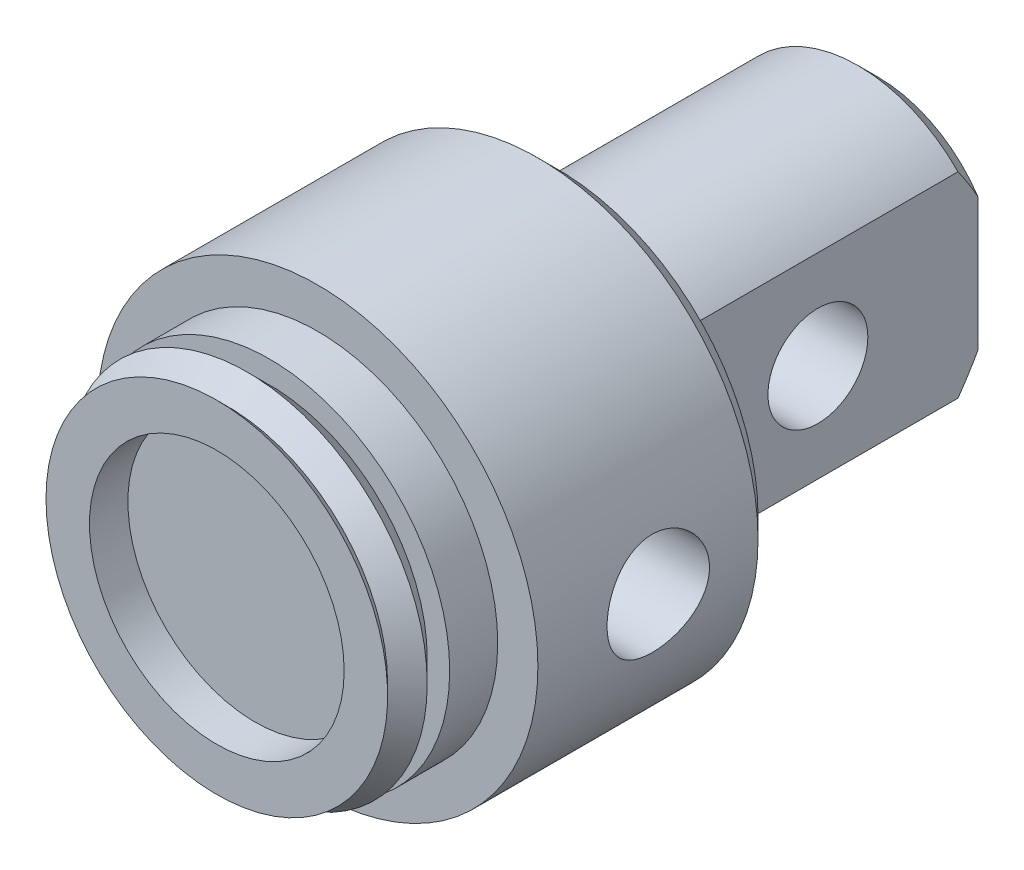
ISO-10303-21;
HEADER;
FILE_DESCRIPTION(('STEP AP214'),'2;1');
FILE_NAME('part.step','',(''),(''),'','','');
FILE_SCHEMA(('AUTOMOTIVE_DESIGN { 1 0 10303 214 1 1 1 1 }'));
ENDSEC;
DATA;
#1=APPLICATION_CONTEXT('core data for automotive mechanical design processes');
#2=APPLICATION_PROTOCOL_DEFINITION('international standard','automotive_design',2000,#1);
#3=PRODUCT_CONTEXT('',#1,'mechanical');
#4=PRODUCT('Part','Part','',(#3));
#5=PRODUCT_RELATED_PRODUCT_CATEGORY('part','',(#4));
#6=PRODUCT_DEFINITION_FORMATION('','',#4);
#7=PRODUCT_DEFINITION_CONTEXT('part definition',#1,'design');
#8=PRODUCT_DEFINITION('design','',#6,#7);
#9=PRODUCT_DEFINITION_SHAPE('','',#8);
#10=(LENGTH_UNIT() NAMED_UNIT(*) SI_UNIT(.MILLI.,.METRE.));
#11=(NAMED_UNIT(*) PLANE_ANGLE_UNIT() SI_UNIT($,.RADIAN.));
#12=(NAMED_UNIT(*) SI_UNIT($,.STERADIAN.) SOLID_ANGLE_UNIT());
#13=UNCERTAINTY_MEASURE_WITH_UNIT(LENGTH_MEASURE(1.E-05),#10,'distance_accuracy_value','');
#14=(GEOMETRIC_REPRESENTATION_CONTEXT(3) GLOBAL_UNCERTAINTY_ASSIGNED_CONTEXT((#13)) GLOBAL_UNIT_ASSIGNED_CONTEXT((#10,
#11,#12)) REPRESENTATION_CONTEXT('',''));
#15=CARTESIAN_POINT('',(0.,0.,0.));
#16=DIRECTION('',(0.,0.,1.));
#17=DIRECTION('',(1.,0.,0.));
#18=AXIS2_PLACEMENT_3D('',#15,#16,#17);
#19=CARTESIAN_POINT('',(0.,0.,-13.523214));
#20=DIRECTION('',(0.,0.,1.));
#21=DIRECTION('',(1.,0.,0.));
#22=AXIS2_PLACEMENT_3D('',#19,#20,#21);
#23=CYLINDRICAL_SURFACE('',#22,8.7376);
#24=CARTESIAN_POINT('',(0.,0.,-12.729464));
#25=DIRECTION('',(0.,0.,-1.));
#26=DIRECTION('',(-1.,0.,0.));
#27=AXIS2_PLACEMENT_3D('',#24,#25,#26);
#28=CIRCLE('',#27,8.7376);
#29=CARTESIAN_POINT('',(8.7376,0.,-12.729464));
#30=VERTEX_POINT('',#29);
#31=EDGE_CURVE('E112',#30,#30,#28,.F.);
#32=ORIENTED_EDGE('',*,*,#31,.T.);
#33=EDGE_LOOP('',(#32));
#34=FACE_BOUND('',#33,.T.);
#35=CARTESIAN_POINT('',(0.,0.,-3.998214));
#36=DIRECTION('',(0.,0.,-1.));
#37=DIRECTION('',(-1.,0.,0.));
#38=AXIS2_PLACEMENT_3D('',#35,#36,#37);
#39=CIRCLE('',#38,8.7376);
#40=CARTESIAN_POINT('',(-8.7376,0.,-3.998214));
#41=VERTEX_POINT('',#40);
#42=EDGE_CURVE('E209',#41,#41,#39,.T.);
#43=ORIENTED_EDGE('',*,*,#42,.T.);
#44=EDGE_LOOP('',(#43));
#45=FACE_BOUND('',#44,.T.);
#46=CARTESIAN_POINT('',(8.7376,0.,-6.741414));
#47=CARTESIAN_POINT('',(8.73759797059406,-0.11251614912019,-6.74141757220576));
#48=CARTESIAN_POINT('',(8.7354047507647,-0.225074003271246,-6.7507908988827));
#49=CARTESIAN_POINT('',(8.72686767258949,-0.446980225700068,-6.78799030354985));
#50=CARTESIAN_POINT('',(8.72052111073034,-0.556326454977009,-6.81582840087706));
#51=CARTESIAN_POINT('',(8.70438234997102,-0.768571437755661,-6.88902854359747));
#52=CARTESIAN_POINT('',(8.6945939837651,-0.871477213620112,-6.9343711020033));
#53=CARTESIAN_POINT('',(8.67262205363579,-1.06821919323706,-7.04122827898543));
#54=CARTESIAN_POINT('',(8.66043848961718,-1.16205539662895,-7.10274289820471));
#55=CARTESIAN_POINT('',(8.63476052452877,-1.33968569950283,-7.2413689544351));
#56=CARTESIAN_POINT('',(8.62124813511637,-1.42329320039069,-7.31871617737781));
#57=CARTESIAN_POINT('',(8.59455904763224,-1.57647313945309,-7.48630623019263));
#58=CARTESIAN_POINT('',(8.58138238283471,-1.64604419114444,-7.57655033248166));
#59=CARTESIAN_POINT('',(8.55667768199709,-1.7700227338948,-7.76878164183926));
#60=CARTESIAN_POINT('',(8.54517260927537,-1.82422727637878,-7.87090295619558));
#61=CARTESIAN_POINT('',(8.52537378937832,-1.91463093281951,-8.0831176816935));
#62=CARTESIAN_POINT('',(8.51707960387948,-1.9508325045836,-8.19321000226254));
#63=CARTESIAN_POINT('',(8.50482562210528,-2.00357737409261,-8.41620527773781));
#64=CARTESIAN_POINT('',(8.50079258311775,-2.02045329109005,-8.5290254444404));
#65=CARTESIAN_POINT('',(8.4972978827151,-2.03510284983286,-8.75596216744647));
#66=CARTESIAN_POINT('',(8.49783558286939,-2.03287915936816,-8.87007854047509));
#67=CARTESIAN_POINT('',(8.50335549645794,-2.00965931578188,-9.09386345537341));
#68=CARTESIAN_POINT('',(8.50824523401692,-1.9890537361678,-9.20357515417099));
#69=CARTESIAN_POINT('',(8.52177157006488,-1.93027563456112,-9.41794037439));
#70=CARTESIAN_POINT('',(8.53040840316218,-1.89210201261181,-9.52259357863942));
#71=CARTESIAN_POINT('',(8.55054421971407,-1.79892392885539,-9.72494736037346));
#72=CARTESIAN_POINT('',(8.56206795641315,-1.7437729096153,-9.82257788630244));
#73=CARTESIAN_POINT('',(8.5866644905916,-1.61830836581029,-10.0073413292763));
#74=CARTESIAN_POINT('',(8.59973752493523,-1.54799252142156,-10.0944726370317));
#75=CARTESIAN_POINT('',(8.62635329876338,-1.39214573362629,-10.2580086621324));
#76=CARTESIAN_POINT('',(8.63989969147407,-1.30628371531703,-10.3340976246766));
#77=CARTESIAN_POINT('',(8.66564488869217,-1.12286054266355,-10.4708516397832));
#78=CARTESIAN_POINT('',(8.67784366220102,-1.02529911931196,-10.5315163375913));
#79=CARTESIAN_POINT('',(8.69956723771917,-0.820833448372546,-10.6357937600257));
#80=CARTESIAN_POINT('',(8.70908487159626,-0.713905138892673,-10.6793608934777));
#81=CARTESIAN_POINT('',(8.72432110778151,-0.493973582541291,-10.7478182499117));
#82=CARTESIAN_POINT('',(8.73004033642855,-0.380971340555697,-10.772711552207));
#83=CARTESIAN_POINT('',(8.73694469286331,-0.15480428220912,-10.8026455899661));
#84=CARTESIAN_POINT('',(8.73822817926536,-0.0416993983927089,-10.8081170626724));
#85=CARTESIAN_POINT('',(8.73639399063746,0.183808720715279,-10.8002255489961));
#86=CARTESIAN_POINT('',(8.73327665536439,0.296212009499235,-10.7868640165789));
#87=CARTESIAN_POINT('',(8.72305358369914,0.515669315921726,-10.7420421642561));
#88=CARTESIAN_POINT('',(8.71599851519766,0.622772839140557,-10.710811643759));
#89=CARTESIAN_POINT('',(8.69869154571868,0.83021894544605,-10.6313965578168));
#90=CARTESIAN_POINT('',(8.68843934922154,0.930560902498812,-10.5832104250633));
#91=CARTESIAN_POINT('',(8.66563542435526,1.123388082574,-10.470381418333));
#92=CARTESIAN_POINT('',(8.65304991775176,1.2157240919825,-10.4054905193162));
#93=CARTESIAN_POINT('',(8.62703722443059,1.3883502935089,-10.2614164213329));
#94=CARTESIAN_POINT('',(8.61360991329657,1.46863869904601,-10.1822311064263));
#95=CARTESIAN_POINT('',(8.58708097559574,1.61662481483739,-10.0098285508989));
#96=CARTESIAN_POINT('',(8.57399212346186,1.68402246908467,-9.91635139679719));
#97=CARTESIAN_POINT('',(8.54994125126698,1.8021675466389,-9.71915445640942));
#98=CARTESIAN_POINT('',(8.53897913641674,1.85291571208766,-9.61543512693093));
#99=CARTESIAN_POINT('',(8.52053551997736,1.93595940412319,-9.40126424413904));
#100=CARTESIAN_POINT('',(8.51303376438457,1.96836256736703,-9.2908562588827));
#101=CARTESIAN_POINT('',(8.5023300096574,2.01410032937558,-9.06596265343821));
#102=CARTESIAN_POINT('',(8.49912721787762,2.02743844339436,-8.95147778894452));
#103=CARTESIAN_POINT('',(8.49743852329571,2.03450298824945,-8.72471694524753));
#104=CARTESIAN_POINT('',(8.49883782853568,2.02870668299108,-8.61245643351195));
#105=CARTESIAN_POINT('',(8.50593357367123,1.99874469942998,-8.39055968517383));
#106=CARTESIAN_POINT('',(8.51162994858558,1.97457929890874,-8.28092340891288));
#107=CARTESIAN_POINT('',(8.52661852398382,1.90880893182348,-8.06782610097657));
#108=CARTESIAN_POINT('',(8.53589461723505,1.86728201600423,-7.96433977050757));
#109=CARTESIAN_POINT('',(8.55700187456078,1.76803152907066,-7.76573523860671));
#110=CARTESIAN_POINT('',(8.56883334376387,1.71030602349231,-7.67061803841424));
#111=CARTESIAN_POINT('',(8.59405451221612,1.5787511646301,-7.48911860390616));
#112=CARTESIAN_POINT('',(8.60747352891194,1.50458544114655,-7.40298420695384));
#113=CARTESIAN_POINT('',(8.63417061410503,1.3429261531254,-7.24422765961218));
#114=CARTESIAN_POINT('',(8.64744864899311,1.2554294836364,-7.17160866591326));
#115=CARTESIAN_POINT('',(8.67260607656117,1.0679992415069,-7.04088613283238));
#116=CARTESIAN_POINT('',(8.68446134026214,0.967897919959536,-6.98301816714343));
#117=CARTESIAN_POINT('',(8.70519060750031,0.759128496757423,-6.88502256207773));
#118=CARTESIAN_POINT('',(8.71406695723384,0.650467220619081,-6.84488095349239));
#119=CARTESIAN_POINT('',(8.72636889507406,0.451515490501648,-6.79012770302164));
#120=CARTESIAN_POINT('',(8.73055328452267,0.362250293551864,-6.7718968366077));
#121=CARTESIAN_POINT('',(8.73616958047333,0.18199909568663,-6.74753888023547));
#122=CARTESIAN_POINT('',(8.73760164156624,0.091013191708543,-6.74141111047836));
#123=CARTESIAN_POINT('',(8.7376,0.,-6.741414));
#124=B_SPLINE_CURVE_WITH_KNOTS('',3,(#46,#47,#48,#49,#50,#51,#52,#53,#54,#55,#56,#57,#58,#59,
#60,#61,#62,#63,#64,#65,#66,#67,#68,#69,#70,#71,#72,#73,#74,#75,#76,#77,#78,#79,#80,#81,#82,#83,
#84,#85,#86,#87,#88,#89,#90,#91,#92,#93,#94,#95,#96,#97,#98,#99,#100,#101,#102,#103,#104,#105,
#106,#107,#108,#109,#110,#111,#112,#113,#114,#115,#116,#117,#118,#119,#120,#121,#122,#123),
.UNSPECIFIED.,.T.,.F.,(4,2,2,2,2,2,2,2,2,2,2,2,2,2,2,2,2,2,2,2,2,2,2,2,2,2,2,2,2,2,2,2,2,2,2,2,
2,2,4),(0.,0.337215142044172,0.674650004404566,1.01171029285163,1.34877059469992,
1.69127297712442,2.0338091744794,2.38067838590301,2.72750022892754,3.06825860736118,
3.40896939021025,3.74260884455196,4.07626919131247,4.41289470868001,4.74957175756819,
5.0945120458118,5.4394602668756,5.78532215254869,6.13112699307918,6.46921292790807,
6.807272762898,7.14107976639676,7.47491763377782,7.81403098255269,8.15319457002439,
8.49948578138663,8.84576155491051,9.18998397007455,9.53414290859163,9.86978309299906,
10.2054182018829,10.5395603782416,10.8737424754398,11.2155243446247,11.5573859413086,
11.9044062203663,12.2511525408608,12.5239378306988,12.7967077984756),.UNSPECIFIED.);
#125=CARTESIAN_POINT('',(8.7376,0.,-6.741414));
#126=VERTEX_POINT('',#125);
#127=EDGE_CURVE('E11',#126,#126,#124,.T.);
#128=ORIENTED_EDGE('',*,*,#127,.F.);
#129=EDGE_LOOP('',(#128));
#130=FACE_BOUND('',#129,.T.);
#131=ADVANCED_FACE('F34',(#34,#45,#130),#23,.T.);
#132=CARTESIAN_POINT('',(0.,0.,-26.223214));
#133=DIRECTION('',(0.,0.,1.));
#134=DIRECTION('',(1.,0.,0.));
#135=AXIS2_PLACEMENT_3D('',#132,#133,#134);
#136=CONICAL_SURFACE('',#135,4.7625,0.785398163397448);
#137=CARTESIAN_POINT('',(3.96875,-11.5797050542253,-18.7447767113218));
#138=CARTESIAN_POINT('',(3.96875,-11.3915793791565,-18.9227365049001));
#139=CARTESIAN_POINT('',(3.96875,-11.2032298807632,-19.1004599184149));
#140=CARTESIAN_POINT('',(3.96875,-10.8260058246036,-19.4553508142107));
#141=CARTESIAN_POINT('',(3.96875,-10.6371312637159,-19.6325182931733));
#142=CARTESIAN_POINT('',(3.96875,-10.0691889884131,-20.1634498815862));
#143=CARTESIAN_POINT('',(3.96875,-9.68921826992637,-20.5162493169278));
#144=CARTESIAN_POINT('',(3.96875,-8.91049316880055,-21.2325892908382));
#145=CARTESIAN_POINT('',(3.96875,-8.51160334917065,-21.5959831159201));
#146=CARTESIAN_POINT('',(3.96875,-7.90965969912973,-22.1366454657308));
#147=CARTESIAN_POINT('',(3.96875,-7.70851399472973,-22.3160376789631));
#148=CARTESIAN_POINT('',(3.96875,-7.30466693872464,-22.6730610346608));
#149=CARTESIAN_POINT('',(3.96875,-7.10196560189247,-22.850692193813));
#150=CARTESIAN_POINT('',(3.96875,-6.69492001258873,-23.2035137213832));
#151=CARTESIAN_POINT('',(3.96875,-6.49057831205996,-23.3787070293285));
#152=CARTESIAN_POINT('',(3.96875,-6.07950066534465,-23.7262892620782));
#153=CARTESIAN_POINT('',(3.96875,-5.87276460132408,-23.8986780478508));
#154=CARTESIAN_POINT('',(3.96875,-5.45558004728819,-24.2403496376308));
#155=CARTESIAN_POINT('',(3.96875,-5.24512147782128,-24.4096201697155));
#156=CARTESIAN_POINT('',(3.96875,-4.82032498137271,-24.7431839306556));
#157=CARTESIAN_POINT('',(3.96875,-4.60598762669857,-24.9074778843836));
#158=CARTESIAN_POINT('',(3.96875,-4.17633240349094,-25.2261697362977));
#159=CARTESIAN_POINT('',(3.96875,-3.96111037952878,-25.3806962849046));
#160=CARTESIAN_POINT('',(3.96875,-3.52404593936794,-25.6805772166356));
#161=CARTESIAN_POINT('',(3.96875,-3.30219898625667,-25.8259250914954));
#162=CARTESIAN_POINT('',(3.96875,-2.96374913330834,-26.0332433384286));
#163=CARTESIAN_POINT('',(3.96875,-2.85031835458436,-26.1003886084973));
#164=CARTESIAN_POINT('',(3.96875,-2.62105613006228,-26.2305080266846));
#165=CARTESIAN_POINT('',(3.96875,-2.50522440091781,-26.2934816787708));
#166=CARTESIAN_POINT('',(3.96875,-2.27107940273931,-26.4142006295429));
#167=CARTESIAN_POINT('',(3.96875,-2.15277021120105,-26.4719537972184));
#168=CARTESIAN_POINT('',(3.96875,-1.9132771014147,-26.5811421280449));
#169=CARTESIAN_POINT('',(3.96875,-1.79209406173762,-26.6325791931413));
#170=CARTESIAN_POINT('',(3.96875,-1.61085207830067,-26.7028515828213));
#171=CARTESIAN_POINT('',(3.96875,-1.55194622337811,-26.7246765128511));
#172=CARTESIAN_POINT('',(3.96875,-1.43345737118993,-26.7663894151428));
#173=CARTESIAN_POINT('',(3.96875,-1.37387441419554,-26.7862775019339));
#174=CARTESIAN_POINT('',(3.96875,-1.19408066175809,-26.8427845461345));
#175=CARTESIAN_POINT('',(3.96875,-1.07284797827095,-26.8762372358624));
#176=CARTESIAN_POINT('',(3.96875,-0.828725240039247,-26.9330901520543));
#177=CARTESIAN_POINT('',(3.96875,-0.70584790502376,-26.9565444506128));
#178=CARTESIAN_POINT('',(3.96875,-0.458498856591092,-26.9924394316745));
#179=CARTESIAN_POINT('',(3.96875,-0.334027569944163,-27.0048830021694));
#180=CARTESIAN_POINT('',(3.96875,-0.0834910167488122,-27.0180717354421));
#181=CARTESIAN_POINT('',(3.96875,0.0425791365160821,-27.0187258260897));
#182=CARTESIAN_POINT('',(3.96875,0.294201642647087,-27.0080607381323));
#183=CARTESIAN_POINT('',(3.96875,0.419753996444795,-26.9967415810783));
#184=CARTESIAN_POINT('',(3.96875,0.669865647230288,-26.9627467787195));
#185=CARTESIAN_POINT('',(3.96875,0.794417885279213,-26.9400200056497));
#186=CARTESIAN_POINT('',(3.96875,1.04122223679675,-26.8844158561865));
#187=CARTESIAN_POINT('',(3.96875,1.16347383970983,-26.8515362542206));
#188=CARTESIAN_POINT('',(3.96875,1.47331242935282,-26.7561397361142));
#189=CARTESIAN_POINT('',(3.96875,1.65896374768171,-26.6873557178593));
#190=CARTESIAN_POINT('',(3.96875,2.02357801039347,-26.5339282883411));
#191=CARTESIAN_POINT('',(3.96875,2.20253552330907,-26.4492723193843));
#192=CARTESIAN_POINT('',(3.96875,2.46728177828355,-26.3131680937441));
#193=CARTESIAN_POINT('',(3.96875,2.55533234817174,-26.2660294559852));
#194=CARTESIAN_POINT('',(3.96875,2.73002734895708,-26.1692078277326));
#195=CARTESIAN_POINT('',(3.96875,2.81667176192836,-26.1195248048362));
#196=CARTESIAN_POINT('',(3.96875,2.98863353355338,-26.0180089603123));
#197=CARTESIAN_POINT('',(3.96875,3.07395147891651,-25.9661771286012));
#198=CARTESIAN_POINT('',(3.96875,3.2434157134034,-25.8606446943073));
#199=CARTESIAN_POINT('',(3.96875,3.32756205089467,-25.8069441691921));
#200=CARTESIAN_POINT('',(3.96875,3.60918250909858,-25.623387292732));
#201=CARTESIAN_POINT('',(3.96875,3.80424621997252,-25.489827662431));
#202=CARTESIAN_POINT('',(3.96875,4.18979319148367,-25.2162298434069));
#203=CARTESIAN_POINT('',(3.96875,4.38027537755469,-25.0761901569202));
#204=CARTESIAN_POINT('',(3.96875,4.75775669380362,-24.7912080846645));
#205=CARTESIAN_POINT('',(3.96875,4.94475300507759,-24.646261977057));
#206=CARTESIAN_POINT('',(3.96875,5.31584156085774,-24.3527450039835));
#207=CARTESIAN_POINT('',(3.96875,5.4999340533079,-24.2041744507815));
#208=CARTESIAN_POINT('',(3.96875,5.86641399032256,-23.9037123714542));
#209=CARTESIAN_POINT('',(3.96875,6.04879367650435,-23.7518114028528));
#210=CARTESIAN_POINT('',(3.96875,6.41165896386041,-23.4457617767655));
#211=CARTESIAN_POINT('',(3.96875,6.5921445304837,-23.2916130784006));
#212=CARTESIAN_POINT('',(3.96875,7.13112689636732,-22.8266248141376));
#213=CARTESIAN_POINT('',(3.96875,7.4873127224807,-22.5131077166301));
#214=CARTESIAN_POINT('',(3.96875,8.15882066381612,-21.9139457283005));
#215=CARTESIAN_POINT('',(3.96875,8.47456215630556,-21.6287682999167));
#216=CARTESIAN_POINT('',(3.96875,9.10350875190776,-21.0555530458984));
#217=CARTESIAN_POINT('',(3.96875,9.41671353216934,-20.7675148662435));
#218=CARTESIAN_POINT('',(3.96875,10.039091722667,-20.1912439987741));
#219=CARTESIAN_POINT('',(3.96875,10.3482780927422,-19.9030252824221));
#220=CARTESIAN_POINT('',(3.96875,10.9650670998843,-19.3249951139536));
#221=CARTESIAN_POINT('',(3.96875,11.2726699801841,-19.0351839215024));
#222=CARTESIAN_POINT('',(3.96875,11.5797050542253,-18.7447767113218));
#223=B_SPLINE_CURVE_WITH_KNOTS('',3,(#137,#138,#139,#140,#141,#142,#143,#144,#145,#146,#147,
#148,#149,#150,#151,#152,#153,#154,#155,#156,#157,#158,#159,#160,#161,#162,#163,#164,#165,#166,
#167,#168,#169,#170,#171,#172,#173,#174,#175,#176,#177,#178,#179,#180,#181,#182,#183,#184,#185,
#186,#187,#188,#189,#190,#191,#192,#193,#194,#195,#196,#197,#198,#199,#200,#201,#202,#203,#204,
#205,#206,#207,#208,#209,#210,#211,#212,#213,#214,#215,#216,#217,#218,#219,#220,#221,#222),
.UNSPECIFIED.,.F.,.F.,(4,2,2,2,2,2,2,2,2,2,2,2,2,2,2,2,2,2,2,2,2,2,2,2,2,2,2,2,2,2,2,2,2,2,2,2,
2,2,2,2,2,2,4),(0.,0.776883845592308,1.55377231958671,3.10926688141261,4.72802398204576,
5.53657693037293,6.34512220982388,7.15258904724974,7.96009579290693,8.77029483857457,
9.58037530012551,10.3750785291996,11.1703390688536,11.5657143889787,11.9611366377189,
12.3559525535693,12.7506492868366,12.9390766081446,13.1274927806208,13.5043991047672,
13.8792404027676,14.2539833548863,14.6316199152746,15.009255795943,15.3885995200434,
15.768026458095,16.3609107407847,16.9542661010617,17.2538565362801,17.5534507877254,
17.8529085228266,18.1523538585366,18.86136186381,19.5705345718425,20.2802578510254,
20.989920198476,21.7019552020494,22.4140031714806,23.837462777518,25.1138344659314,
26.3903661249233,27.6584278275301,28.9262885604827),.UNSPECIFIED.);
#224=CARTESIAN_POINT('',(3.96875,-3.8885649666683,-25.429464));
#225=VERTEX_POINT('',#224);
#226=CARTESIAN_POINT('',(3.96875,-2.6325709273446,-26.223214));
#227=VERTEX_POINT('',#226);
#228=EDGE_CURVE('E92',#225,#227,#223,.T.);
#229=ORIENTED_EDGE('',*,*,#228,.F.);
#230=CARTESIAN_POINT('',(0.,0.,-25.429464));
#231=DIRECTION('',(0.,0.,-1.));
#232=DIRECTION('',(-1.,0.,0.));
#233=AXIS2_PLACEMENT_3D('',#230,#231,#232);
#234=CIRCLE('',#233,5.55625);
#235=CARTESIAN_POINT('',(-3.96875,-3.88856496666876,-25.4294639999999));
#236=VERTEX_POINT('',#235);
#237=EDGE_CURVE('E120',#236,#225,#234,.F.);
#238=ORIENTED_EDGE('',*,*,#237,.F.);
#239=CARTESIAN_POINT('',(-3.96875,11.5797050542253,-18.7447767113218));
#240=CARTESIAN_POINT('',(-3.96875,11.3915793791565,-18.9227365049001));
#241=CARTESIAN_POINT('',(-3.96875,11.2032298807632,-19.1004599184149));
#242=CARTESIAN_POINT('',(-3.96875,10.8260058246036,-19.4553508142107));
#243=CARTESIAN_POINT('',(-3.96875,10.6371312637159,-19.6325182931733));
#244=CARTESIAN_POINT('',(-3.96875,10.0691889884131,-20.1634498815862));
#245=CARTESIAN_POINT('',(-3.96875,9.68921826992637,-20.5162493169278));
#246=CARTESIAN_POINT('',(-3.96875,8.91049316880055,-21.2325892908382));
#247=CARTESIAN_POINT('',(-3.96875,8.51160334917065,-21.5959831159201));
#248=CARTESIAN_POINT('',(-3.96875,7.90965969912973,-22.1366454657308));
#249=CARTESIAN_POINT('',(-3.96875,7.70851399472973,-22.3160376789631));
#250=CARTESIAN_POINT('',(-3.96875,7.30466693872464,-22.6730610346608));
#251=CARTESIAN_POINT('',(-3.96875,7.10196560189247,-22.850692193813));
#252=CARTESIAN_POINT('',(-3.96875,6.69492001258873,-23.2035137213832));
#253=CARTESIAN_POINT('',(-3.96875,6.49057831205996,-23.3787070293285));
#254=CARTESIAN_POINT('',(-3.96875,6.07950066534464,-23.7262892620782));
#255=CARTESIAN_POINT('',(-3.96875,5.87276460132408,-23.8986780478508));
#256=CARTESIAN_POINT('',(-3.96875,5.45558004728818,-24.2403496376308));
#257=CARTESIAN_POINT('',(-3.96875,5.24512147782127,-24.4096201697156));
#258=CARTESIAN_POINT('',(-3.96875,4.82032498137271,-24.7431839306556));
#259=CARTESIAN_POINT('',(-3.96875,4.60598762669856,-24.9074778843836));
#260=CARTESIAN_POINT('',(-3.96875,4.17633240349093,-25.2261697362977));
#261=CARTESIAN_POINT('',(-3.96875,3.96111037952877,-25.3806962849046));
#262=CARTESIAN_POINT('',(-3.96875,3.52404593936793,-25.6805772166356));
#263=CARTESIAN_POINT('',(-3.96875,3.30219898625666,-25.8259250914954));
#264=CARTESIAN_POINT('',(-3.96875,2.96374913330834,-26.0332433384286));
#265=CARTESIAN_POINT('',(-3.96875,2.85031835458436,-26.1003886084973));
#266=CARTESIAN_POINT('',(-3.96875,2.62105613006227,-26.2305080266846));
#267=CARTESIAN_POINT('',(-3.96875,2.5052244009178,-26.2934816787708));
#268=CARTESIAN_POINT('',(-3.96875,2.2710794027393,-26.4142006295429));
#269=CARTESIAN_POINT('',(-3.96875,2.15277021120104,-26.4719537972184));
#270=CARTESIAN_POINT('',(-3.96875,1.91327710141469,-26.5811421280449));
#271=CARTESIAN_POINT('',(-3.96875,1.79209406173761,-26.6325791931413));
#272=CARTESIAN_POINT('',(-3.96875,1.61085207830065,-26.7028515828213));
#273=CARTESIAN_POINT('',(-3.96875,1.5519462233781,-26.7246765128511));
#274=CARTESIAN_POINT('',(-3.96875,1.43345737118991,-26.7663894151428));
#275=CARTESIAN_POINT('',(-3.96875,1.37387441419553,-26.7862775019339));
#276=CARTESIAN_POINT('',(-3.96875,1.19408066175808,-26.8427845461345));
#277=CARTESIAN_POINT('',(-3.96875,1.07284797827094,-26.8762372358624));
#278=CARTESIAN_POINT('',(-3.96875,0.828725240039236,-26.9330901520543));
#279=CARTESIAN_POINT('',(-3.96875,0.705847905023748,-26.9565444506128));
#280=CARTESIAN_POINT('',(-3.96875,0.458498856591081,-26.9924394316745));
#281=CARTESIAN_POINT('',(-3.96875,0.334027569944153,-27.0048830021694));
#282=CARTESIAN_POINT('',(-3.96875,0.0834910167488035,-27.0180717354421));
#283=CARTESIAN_POINT('',(-3.96875,-0.0425791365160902,-27.0187258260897));
#284=CARTESIAN_POINT('',(-3.96875,-0.294201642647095,-27.0080607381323));
#285=CARTESIAN_POINT('',(-3.96875,-0.419753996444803,-26.9967415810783));
#286=CARTESIAN_POINT('',(-3.96875,-0.669865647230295,-26.9627467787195));
#287=CARTESIAN_POINT('',(-3.96875,-0.79441788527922,-26.9400200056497));
#288=CARTESIAN_POINT('',(-3.96875,-1.04122223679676,-26.8844158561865));
#289=CARTESIAN_POINT('',(-3.96875,-1.16347383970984,-26.8515362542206));
#290=CARTESIAN_POINT('',(-3.96875,-1.47331242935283,-26.7561397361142));
#291=CARTESIAN_POINT('',(-3.96875,-1.65896374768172,-26.6873557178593));
#292=CARTESIAN_POINT('',(-3.96875,-2.02357801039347,-26.5339282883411));
#293=CARTESIAN_POINT('',(-3.96875,-2.20253552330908,-26.4492723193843));
#294=CARTESIAN_POINT('',(-3.96875,-2.46728177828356,-26.3131680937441));
#295=CARTESIAN_POINT('',(-3.96875,-2.55533234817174,-26.2660294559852));
#296=CARTESIAN_POINT('',(-3.96875,-2.73002734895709,-26.1692078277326));
#297=CARTESIAN_POINT('',(-3.96875,-2.81667176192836,-26.1195248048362));
#298=CARTESIAN_POINT('',(-3.96875,-2.98863353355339,-26.0180089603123));
#299=CARTESIAN_POINT('',(-3.96875,-3.07395147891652,-25.9661771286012));
#300=CARTESIAN_POINT('',(-3.96875,-3.24341571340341,-25.8606446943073));
#301=CARTESIAN_POINT('',(-3.96875,-3.32756205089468,-25.8069441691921));
#302=CARTESIAN_POINT('',(-3.96875,-3.60918250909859,-25.623387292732));
#303=CARTESIAN_POINT('',(-3.96875,-3.80424621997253,-25.489827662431));
#304=CARTESIAN_POINT('',(-3.96875,-4.18979319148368,-25.2162298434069));
#305=CARTESIAN_POINT('',(-3.96875,-4.3802753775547,-25.0761901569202));
#306=CARTESIAN_POINT('',(-3.96875,-4.75775669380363,-24.7912080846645));
#307=CARTESIAN_POINT('',(-3.96875,-4.9447530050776,-24.646261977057));
#308=CARTESIAN_POINT('',(-3.96875,-5.31584156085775,-24.3527450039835));
#309=CARTESIAN_POINT('',(-3.96875,-5.49993405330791,-24.2041744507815));
#310=CARTESIAN_POINT('',(-3.96875,-5.86641399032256,-23.9037123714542));
#311=CARTESIAN_POINT('',(-3.96875,-6.04879367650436,-23.7518114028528));
#312=CARTESIAN_POINT('',(-3.96875,-6.41165896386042,-23.4457617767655));
#313=CARTESIAN_POINT('',(-3.96875,-6.59214453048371,-23.2916130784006));
#314=CARTESIAN_POINT('',(-3.96875,-7.13112689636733,-22.8266248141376));
#315=CARTESIAN_POINT('',(-3.96875,-7.48731272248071,-22.5131077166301));
#316=CARTESIAN_POINT('',(-3.96875,-8.15882066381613,-21.9139457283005));
#317=CARTESIAN_POINT('',(-3.96875,-8.47456215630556,-21.6287682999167));
#318=CARTESIAN_POINT('',(-3.96875,-9.10350875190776,-21.0555530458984));
#319=CARTESIAN_POINT('',(-3.96875,-9.41671353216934,-20.7675148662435));
#320=CARTESIAN_POINT('',(-3.96875,-10.039091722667,-20.1912439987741));
#321=CARTESIAN_POINT('',(-3.96875,-10.3482780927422,-19.9030252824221));
#322=CARTESIAN_POINT('',(-3.96875,-10.9650670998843,-19.3249951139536));
#323=CARTESIAN_POINT('',(-3.96875,-11.2726699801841,-19.0351839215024));
#324=CARTESIAN_POINT('',(-3.96875,-11.5797050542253,-18.7447767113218));
#325=B_SPLINE_CURVE_WITH_KNOTS('',3,(#239,#240,#241,#242,#243,#244,#245,#246,#247,#248,#249,
#250,#251,#252,#253,#254,#255,#256,#257,#258,#259,#260,#261,#262,#263,#264,#265,#266,#267,#268,
#269,#270,#271,#272,#273,#274,#275,#276,#277,#278,#279,#280,#281,#282,#283,#284,#285,#286,#287,
#288,#289,#290,#291,#292,#293,#294,#295,#296,#297,#298,#299,#300,#301,#302,#303,#304,#305,#306,
#307,#308,#309,#310,#311,#312,#313,#314,#315,#316,#317,#318,#319,#320,#321,#322,#323,#324),
.UNSPECIFIED.,.F.,.F.,(4,2,2,2,2,2,2,2,2,2,2,2,2,2,2,2,2,2,2,2,2,2,2,2,2,2,2,2,2,2,2,2,2,2,2,2,
2,2,2,2,2,2,4),(0.,0.776883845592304,1.55377231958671,3.10926688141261,4.72802398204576,
5.53657693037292,6.34512220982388,7.15258904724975,7.96009579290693,8.77029483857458,
9.58037530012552,10.3750785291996,11.1703390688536,11.5657143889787,11.961136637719,
12.3559525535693,12.7506492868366,12.9390766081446,13.1274927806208,13.5043991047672,
13.8792404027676,14.2539833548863,14.6316199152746,15.009255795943,15.3885995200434,
15.768026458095,16.3609107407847,16.9542661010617,17.2538565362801,17.5534507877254,
17.8529085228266,18.1523538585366,18.86136186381,19.5705345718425,20.2802578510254,
20.9899201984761,21.7019552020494,22.4140031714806,23.837462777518,25.1138344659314,
26.3903661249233,27.6584278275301,28.9262885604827),.UNSPECIFIED.);
#326=CARTESIAN_POINT('',(-3.96875,-2.6325709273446,-26.223214));
#327=VERTEX_POINT('',#326);
#328=EDGE_CURVE('E111',#327,#236,#325,.T.);
#329=ORIENTED_EDGE('',*,*,#328,.F.);
#330=CARTESIAN_POINT('',(0.,0.,-26.223214));
#331=DIRECTION('',(0.,0.,-1.));
#332=DIRECTION('',(-1.,0.,0.));
#333=AXIS2_PLACEMENT_3D('',#330,#331,#332);
#334=CIRCLE('',#333,4.7625);
#335=EDGE_CURVE('E62',#227,#327,#334,.T.);
#336=ORIENTED_EDGE('',*,*,#335,.F.);
#337=EDGE_LOOP('',(#229,#238,#329,#336));
#338=FACE_BOUND('',#337,.T.);
#339=ADVANCED_FACE('F110',(#338),#136,.T.);
#340=CARTESIAN_POINT('',(0.,0.,-13.523214));
#341=DIRECTION('',(0.,0.,-1.));
#342=DIRECTION('',(-1.,0.,0.));
#343=AXIS2_PLACEMENT_3D('',#340,#341,#342);
#344=PLANE('',#343);
#345=CARTESIAN_POINT('',(0.,0.,-13.523214));
#346=DIRECTION('',(0.,0.,-1.));
#347=DIRECTION('',(-1.,0.,0.));
#348=AXIS2_PLACEMENT_3D('',#345,#346,#347);
#349=CIRCLE('',#348,7.94385000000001);
#350=CARTESIAN_POINT('',(7.94385000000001,0.,-13.523214));
#351=VERTEX_POINT('',#350);
#352=EDGE_CURVE('E116',#351,#351,#349,.T.);
#353=ORIENTED_EDGE('',*,*,#352,.T.);
#354=EDGE_LOOP('',(#353));
#355=FACE_BOUND('',#354,.T.);
#356=CARTESIAN_POINT('',(0.,0.,-13.523214));
#357=DIRECTION('',(0.,0.,-1.));
#358=DIRECTION('',(-1.,0.,0.));
#359=AXIS2_PLACEMENT_3D('',#356,#357,#358);
#360=CIRCLE('',#359,5.55625);
#361=CARTESIAN_POINT('',(-5.55625,0.,-13.523214));
#362=VERTEX_POINT('',#361);
#363=EDGE_CURVE('E212',#362,#362,#360,.T.);
#364=ORIENTED_EDGE('',*,*,#363,.F.);
#365=EDGE_LOOP('',(#364));
#366=FACE_BOUND('',#365,.T.);
#367=ADVANCED_FACE('F147',(#355,#366),#344,.T.);
#368=CARTESIAN_POINT('',(0.,0.,0.));
#369=DIRECTION('',(0.,0.,1.));
#370=DIRECTION('',(1.,0.,0.));
#371=AXIS2_PLACEMENT_3D('',#368,#369,#370);
#372=PLANE('',#371);
#373=CARTESIAN_POINT('',(0.,0.,0.));
#374=DIRECTION('',(0.,0.,1.));
#375=DIRECTION('',(1.,0.,0.));
#376=AXIS2_PLACEMENT_3D('',#373,#374,#375);
#377=CIRCLE('',#376,5.05092480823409);
#378=CARTESIAN_POINT('',(5.05092480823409,0.,0.));
#379=VERTEX_POINT('',#378);
#380=EDGE_CURVE('E241',#379,#379,#377,.T.);
#381=ORIENTED_EDGE('',*,*,#380,.F.);
#382=EDGE_LOOP('',(#381));
#383=FACE_BOUND('',#382,.T.);
#384=CARTESIAN_POINT('',(0.,0.,0.));
#385=DIRECTION('',(0.,0.,-1.));
#386=DIRECTION('',(-1.,0.,0.));
#387=AXIS2_PLACEMENT_3D('',#384,#385,#386);
#388=CIRCLE('',#387,6.77545);
#389=CARTESIAN_POINT('',(-6.77545,0.,0.));
#390=VERTEX_POINT('',#389);
#391=EDGE_CURVE('E190',#390,#390,#388,.T.);
#392=ORIENTED_EDGE('',*,*,#391,.F.);
#393=EDGE_LOOP('',(#392));
#394=FACE_BOUND('',#393,.T.);
#395=ADVANCED_FACE('F150',(#383,#394),#372,.T.);
#396=CARTESIAN_POINT('',(0.,0.,-0.416559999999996));
#397=DIRECTION('',(0.,0.,1.));
#398=DIRECTION('',(1.,0.,0.));
#399=AXIS2_PLACEMENT_3D('',#396,#397,#398);
#400=CONICAL_SURFACE('',#399,6.35889,0.785398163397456);
#401=ORIENTED_EDGE('',*,*,#391,.T.);
#402=EDGE_LOOP('',(#401));
#403=FACE_BOUND('',#402,.T.);
#404=CARTESIAN_POINT('',(0.,0.,-0.416559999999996));
#405=DIRECTION('',(0.,0.,-1.));
#406=DIRECTION('',(-1.,0.,0.));
#407=AXIS2_PLACEMENT_3D('',#404,#405,#406);
#408=CIRCLE('',#407,6.35889);
#409=CARTESIAN_POINT('',(-6.35889,0.,-0.416559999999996));
#410=VERTEX_POINT('',#409);
#411=EDGE_CURVE('E192',#410,#410,#408,.T.);
#412=ORIENTED_EDGE('',*,*,#411,.F.);
#413=EDGE_LOOP('',(#412));
#414=FACE_BOUND('',#413,.T.);
#415=ADVANCED_FACE('F173',(#403,#414),#400,.T.);
#416=CARTESIAN_POINT('',(0.,0.,-1.20141999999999));
#417=DIRECTION('',(0.,0.,-1.));
#418=DIRECTION('',(-1.,0.,0.));
#419=AXIS2_PLACEMENT_3D('',#416,#417,#418);
#420=CONICAL_SURFACE('',#419,7.14374999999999,0.785398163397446);
#421=ORIENTED_EDGE('',*,*,#411,.T.);
#422=EDGE_LOOP('',(#421));
#423=FACE_BOUND('',#422,.T.);
#424=CARTESIAN_POINT('',(0.,0.,-1.20141999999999));
#425=DIRECTION('',(0.,0.,-1.));
#426=DIRECTION('',(-1.,0.,0.));
#427=AXIS2_PLACEMENT_3D('',#424,#425,#426);
#428=CIRCLE('',#427,7.14374999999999);
#429=CARTESIAN_POINT('',(-7.14374999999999,0.,-1.20141999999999));
#430=VERTEX_POINT('',#429);
#431=EDGE_CURVE('E197',#430,#430,#428,.T.);
#432=ORIENTED_EDGE('',*,*,#431,.F.);
#433=EDGE_LOOP('',(#432));
#434=FACE_BOUND('',#433,.T.);
#435=ADVANCED_FACE('F169',(#423,#434),#420,.T.);
#436=CARTESIAN_POINT('',(0.,0.,-2.093214));
#437=DIRECTION('',(0.,0.,1.));
#438=DIRECTION('',(1.,0.,0.));
#439=AXIS2_PLACEMENT_3D('',#436,#437,#438);
#440=CONICAL_SURFACE('',#439,6.25195599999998,0.785398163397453);
#441=ORIENTED_EDGE('',*,*,#431,.T.);
#442=EDGE_LOOP('',(#441));
#443=FACE_BOUND('',#442,.T.);
#444=CARTESIAN_POINT('',(0.,0.,-2.093214));
#445=DIRECTION('',(0.,0.,-1.));
#446=DIRECTION('',(-1.,0.,0.));
#447=AXIS2_PLACEMENT_3D('',#444,#445,#446);
#448=CIRCLE('',#447,6.25195599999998);
#449=CARTESIAN_POINT('',(-6.25195599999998,0.,-2.093214));
#450=VERTEX_POINT('',#449);
#451=EDGE_CURVE('E200',#450,#450,#448,.T.);
#452=ORIENTED_EDGE('',*,*,#451,.F.);
#453=EDGE_LOOP('',(#452));
#454=FACE_BOUND('',#453,.T.);
#455=ADVANCED_FACE('F165',(#443,#454),#440,.T.);
#456=CARTESIAN_POINT('',(0.,6.25195599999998,-2.093214));
#457=DIRECTION('',(0.,0.,1.));
#458=DIRECTION('',(1.,0.,0.));
#459=AXIS2_PLACEMENT_3D('',#456,#457,#458);
#460=PLANE('',#459);
#461=ORIENTED_EDGE('',*,*,#451,.T.);
#462=EDGE_LOOP('',(#461));
#463=FACE_BOUND('',#462,.T.);
#464=CARTESIAN_POINT('',(0.,0.,-2.093214));
#465=DIRECTION('',(0.,0.,-1.));
#466=DIRECTION('',(-1.,0.,0.));
#467=AXIS2_PLACEMENT_3D('',#464,#465,#466);
#468=CIRCLE('',#467,7.14374999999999);
#469=CARTESIAN_POINT('',(-7.14374999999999,0.,-2.093214));
#470=VERTEX_POINT('',#469);
#471=EDGE_CURVE('E203',#470,#470,#468,.T.);
#472=ORIENTED_EDGE('',*,*,#471,.F.);
#473=EDGE_LOOP('',(#472));
#474=FACE_BOUND('',#473,.T.);
#475=ADVANCED_FACE('F161',(#463,#474),#460,.T.);
#476=CARTESIAN_POINT('',(0.,0.,-71.2941240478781));
#477=DIRECTION('',(0.,0.,-1.));
#478=DIRECTION('',(-1.,0.,0.));
#479=AXIS2_PLACEMENT_3D('',#476,#477,#478);
#480=CYLINDRICAL_SURFACE('',#479,7.14374999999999);
#481=ORIENTED_EDGE('',*,*,#471,.T.);
#482=EDGE_LOOP('',(#481));
#483=FACE_BOUND('',#482,.T.);
#484=CARTESIAN_POINT('',(0.,0.,-3.998214));
#485=DIRECTION('',(0.,0.,-1.));
#486=DIRECTION('',(-1.,0.,0.));
#487=AXIS2_PLACEMENT_3D('',#484,#485,#486);
#488=CIRCLE('',#487,7.14374999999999);
#489=CARTESIAN_POINT('',(-7.14374999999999,0.,-3.998214));
#490=VERTEX_POINT('',#489);
#491=EDGE_CURVE('E206',#490,#490,#488,.T.);
#492=ORIENTED_EDGE('',*,*,#491,.F.);
#493=EDGE_LOOP('',(#492));
#494=FACE_BOUND('',#493,.T.);
#495=ADVANCED_FACE('F153',(#483,#494),#480,.T.);
#496=CARTESIAN_POINT('',(0.,0.,-3.998214));
#497=DIRECTION('',(0.,0.,-1.));
#498=DIRECTION('',(-1.,0.,0.));
#499=AXIS2_PLACEMENT_3D('',#496,#497,#498);
#500=PLANE('',#499);
#501=ORIENTED_EDGE('',*,*,#491,.T.);
#502=EDGE_LOOP('',(#501));
#503=FACE_BOUND('',#502,.T.);
#504=ORIENTED_EDGE('',*,*,#42,.F.);
#505=EDGE_LOOP('',(#504));
#506=FACE_BOUND('',#505,.T.);
#507=ADVANCED_FACE('F145',(#503,#506),#500,.F.);
#508=CARTESIAN_POINT('',(0.,0.,-26.223214));
#509=DIRECTION('',(0.,0.,1.));
#510=DIRECTION('',(1.,0.,0.));
#511=AXIS2_PLACEMENT_3D('',#508,#509,#510);
#512=CYLINDRICAL_SURFACE('',#511,5.55625);
#513=ORIENTED_EDGE('',*,*,#237,.T.);
#514=DIRECTION('',(0.,0.,1.));
#515=VECTOR('',#514,1.);
#516=CARTESIAN_POINT('',(3.96875,-3.8885649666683,-26.223214));
#517=LINE('',#516,#515);
#518=CARTESIAN_POINT('',(3.96875,-3.8885649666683,-14.336014));
#519=VERTEX_POINT('',#518);
#520=EDGE_CURVE('E96',#225,#519,#517,.T.);
#521=ORIENTED_EDGE('',*,*,#520,.T.);
#522=CARTESIAN_POINT('',(0.,0.,-14.336014));
#523=DIRECTION('',(0.,0.,-1.));
#524=DIRECTION('',(-1.,0.,0.));
#525=AXIS2_PLACEMENT_3D('',#522,#523,#524);
#526=CIRCLE('',#525,5.55625);
#527=CARTESIAN_POINT('',(3.96875,3.8885649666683,-14.336014));
#528=VERTEX_POINT('',#527);
#529=EDGE_CURVE('E48',#528,#519,#526,.T.);
#530=ORIENTED_EDGE('',*,*,#529,.F.);
#531=DIRECTION('',(0.,0.,1.));
#532=VECTOR('',#531,1.);
#533=CARTESIAN_POINT('',(3.96875,3.8885649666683,-26.223214));
#534=LINE('',#533,#532);
#535=CARTESIAN_POINT('',(3.96875,3.88856496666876,-25.4294639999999));
#536=VERTEX_POINT('',#535);
#537=EDGE_CURVE('E227',#528,#536,#534,.F.);
#538=ORIENTED_EDGE('',*,*,#537,.T.);
#539=CARTESIAN_POINT('',(-3.96875,3.8885649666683,-25.429464));
#540=VERTEX_POINT('',#539);
#541=EDGE_CURVE('E114',#536,#540,#234,.F.);
#542=ORIENTED_EDGE('',*,*,#541,.T.);
#543=DIRECTION('',(0.,0.,1.));
#544=VECTOR('',#543,1.);
#545=CARTESIAN_POINT('',(-3.96875,3.88856496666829,-26.223214));
#546=LINE('',#545,#544);
#547=CARTESIAN_POINT('',(-3.96875,3.88856496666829,-14.336014));
#548=VERTEX_POINT('',#547);
#549=EDGE_CURVE('E215',#540,#548,#546,.T.);
#550=ORIENTED_EDGE('',*,*,#549,.T.);
#551=CARTESIAN_POINT('',(0.,0.,-14.336014));
#552=DIRECTION('',(0.,0.,-1.));
#553=DIRECTION('',(-1.,0.,0.));
#554=AXIS2_PLACEMENT_3D('',#551,#552,#553);
#555=CIRCLE('',#554,5.55625);
#556=CARTESIAN_POINT('',(-3.96875,-3.88856496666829,-14.336014));
#557=VERTEX_POINT('',#556);
#558=EDGE_CURVE('E129',#557,#548,#555,.T.);
#559=ORIENTED_EDGE('',*,*,#558,.F.);
#560=DIRECTION('',(0.,0.,1.));
#561=VECTOR('',#560,1.);
#562=CARTESIAN_POINT('',(-3.96875,-3.88856496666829,-26.223214));
#563=LINE('',#562,#561);
#564=EDGE_CURVE('E218',#557,#236,#563,.F.);
#565=ORIENTED_EDGE('',*,*,#564,.T.);
#566=EDGE_LOOP('',(#513,#521,#530,#538,#542,#550,#559,#565));
#567=FACE_BOUND('',#566,.T.);
#568=ORIENTED_EDGE('',*,*,#363,.T.);
#569=EDGE_LOOP('',(#568));
#570=FACE_BOUND('',#569,.T.);
#571=ADVANCED_FACE('F142',(#567,#570),#512,.T.);
#572=CARTESIAN_POINT('',(0.,0.,-26.223214));
#573=DIRECTION('',(0.,0.,-1.));
#574=DIRECTION('',(-1.,0.,0.));
#575=AXIS2_PLACEMENT_3D('',#572,#573,#574);
#576=PLANE('',#575);
#577=DIRECTION('',(0.,1.,0.));
#578=VECTOR('',#577,1.);
#579=CARTESIAN_POINT('',(3.96875,6.35,-26.223214));
#580=LINE('',#579,#578);
#581=CARTESIAN_POINT('',(3.96875,2.6325709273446,-26.223214));
#582=VERTEX_POINT('',#581);
#583=EDGE_CURVE('E55',#227,#582,#580,.T.);
#584=ORIENTED_EDGE('',*,*,#583,.F.);
#585=ORIENTED_EDGE('',*,*,#335,.T.);
#586=DIRECTION('',(0.,-1.,0.));
#587=VECTOR('',#586,1.);
#588=CARTESIAN_POINT('',(-3.96875,6.35,-26.223214));
#589=LINE('',#588,#587);
#590=CARTESIAN_POINT('',(-3.96875,2.6325709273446,-26.223214));
#591=VERTEX_POINT('',#590);
#592=EDGE_CURVE('E222',#591,#327,#589,.T.);
#593=ORIENTED_EDGE('',*,*,#592,.F.);
#594=EDGE_CURVE('E105',#591,#582,#334,.T.);
#595=ORIENTED_EDGE('',*,*,#594,.T.);
#596=EDGE_LOOP('',(#584,#585,#593,#595));
#597=FACE_BOUND('',#596,.T.);
#598=ADVANCED_FACE('F103',(#597),#576,.T.);
#599=CARTESIAN_POINT('',(0.,0.,-13.523214));
#600=DIRECTION('',(0.,0.,1.));
#601=DIRECTION('',(1.,0.,0.));
#602=AXIS2_PLACEMENT_3D('',#599,#600,#601);
#603=CONICAL_SURFACE('',#602,7.94385000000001,0.785398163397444);
#604=CARTESIAN_POINT('',(8.7376,0.,-12.729464));
#605=CARTESIAN_POINT('',(8.72933177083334,0.,-12.7377322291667));
#606=CARTESIAN_POINT('',(8.72106354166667,0.,-12.7460004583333));
#607=CARTESIAN_POINT('',(8.70452708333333,0.,-12.7625369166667));
#608=CARTESIAN_POINT('',(8.69625885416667,0.,-12.7708051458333));
#609=CARTESIAN_POINT('',(8.67972239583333,0.,-12.7873416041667));
#610=CARTESIAN_POINT('',(8.67145416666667,0.,-12.7956098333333));
#611=CARTESIAN_POINT('',(8.65491770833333,0.,-12.8121462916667));
#612=CARTESIAN_POINT('',(8.64664947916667,0.,-12.8204145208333));
#613=CARTESIAN_POINT('',(8.63011302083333,0.,-12.8369509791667));
#614=CARTESIAN_POINT('',(8.62184479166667,0.,-12.8452192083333));
#615=CARTESIAN_POINT('',(8.60530833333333,0.,-12.8617556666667));
#616=CARTESIAN_POINT('',(8.59704010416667,0.,-12.8700238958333));
#617=CARTESIAN_POINT('',(8.58050364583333,0.,-12.8865603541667));
#618=CARTESIAN_POINT('',(8.57223541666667,0.,-12.8948285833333));
#619=CARTESIAN_POINT('',(8.55569895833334,0.,-12.9113650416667));
#620=CARTESIAN_POINT('',(8.54743072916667,0.,-12.9196332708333));
#621=CARTESIAN_POINT('',(8.53089427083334,0.,-12.9361697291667));
#622=CARTESIAN_POINT('',(8.52262604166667,0.,-12.9444379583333));
#623=CARTESIAN_POINT('',(8.50608958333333,0.,-12.9609744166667));
#624=CARTESIAN_POINT('',(8.49782135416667,0.,-12.9692426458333));
#625=CARTESIAN_POINT('',(8.48128489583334,0.,-12.9857791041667));
#626=CARTESIAN_POINT('',(8.47301666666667,0.,-12.9940473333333));
#627=CARTESIAN_POINT('',(8.45648020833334,0.,-13.0105837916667));
#628=CARTESIAN_POINT('',(8.44821197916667,0.,-13.0188520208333));
#629=CARTESIAN_POINT('',(8.43167552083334,0.,-13.0353884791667));
#630=CARTESIAN_POINT('',(8.42340729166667,0.,-13.0436567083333));
#631=CARTESIAN_POINT('',(8.40687083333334,0.,-13.0601931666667));
#632=CARTESIAN_POINT('',(8.39860260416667,0.,-13.0684613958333));
#633=CARTESIAN_POINT('',(8.38206614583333,0.,-13.0849978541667));
#634=CARTESIAN_POINT('',(8.37379791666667,0.,-13.0932660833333));
#635=CARTESIAN_POINT('',(8.35726145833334,0.,-13.1098025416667));
#636=CARTESIAN_POINT('',(8.34899322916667,0.,-13.1180707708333));
#637=CARTESIAN_POINT('',(8.33245677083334,0.,-13.1346072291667));
#638=CARTESIAN_POINT('',(8.32418854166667,0.,-13.1428754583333));
#639=CARTESIAN_POINT('',(8.30765208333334,0.,-13.1594119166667));
#640=CARTESIAN_POINT('',(8.29938385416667,0.,-13.1676801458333));
#641=CARTESIAN_POINT('',(8.28284739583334,0.,-13.1842166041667));
#642=CARTESIAN_POINT('',(8.27457916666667,0.,-13.1924848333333));
#643=CARTESIAN_POINT('',(8.25804270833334,0.,-13.2090212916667));
#644=CARTESIAN_POINT('',(8.24977447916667,0.,-13.2172895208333));
#645=CARTESIAN_POINT('',(8.23323802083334,0.,-13.2338259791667));
#646=CARTESIAN_POINT('',(8.22496979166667,0.,-13.2420942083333));
#647=CARTESIAN_POINT('',(8.20843333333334,0.,-13.2586306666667));
#648=CARTESIAN_POINT('',(8.20016510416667,0.,-13.2668988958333));
#649=CARTESIAN_POINT('',(8.18362864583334,0.,-13.2834353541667));
#650=CARTESIAN_POINT('',(8.17536041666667,0.,-13.2917035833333));
#651=CARTESIAN_POINT('',(8.15882395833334,0.,-13.3082400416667));
#652=CARTESIAN_POINT('',(8.15055572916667,0.,-13.3165082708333));
#653=CARTESIAN_POINT('',(8.13401927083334,0.,-13.3330447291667));
#654=CARTESIAN_POINT('',(8.12575104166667,0.,-13.3413129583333));
#655=CARTESIAN_POINT('',(8.10921458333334,0.,-13.3578494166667));
#656=CARTESIAN_POINT('',(8.10094635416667,0.,-13.3661176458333));
#657=CARTESIAN_POINT('',(8.08440989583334,0.,-13.3826541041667));
#658=CARTESIAN_POINT('',(8.07614166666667,0.,-13.3909223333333));
#659=CARTESIAN_POINT('',(8.05960520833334,0.,-13.4074587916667));
#660=CARTESIAN_POINT('',(8.05133697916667,0.,-13.4157270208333));
#661=CARTESIAN_POINT('',(8.03480052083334,0.,-13.4322634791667));
#662=CARTESIAN_POINT('',(8.02653229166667,0.,-13.4405317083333));
#663=CARTESIAN_POINT('',(8.00999583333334,0.,-13.4570681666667));
#664=CARTESIAN_POINT('',(8.00172760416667,0.,-13.4653363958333));
#665=CARTESIAN_POINT('',(7.98519114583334,0.,-13.4818728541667));
#666=CARTESIAN_POINT('',(7.97692291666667,0.,-13.4901410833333));
#667=CARTESIAN_POINT('',(7.96038645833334,0.,-13.5066775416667));
#668=CARTESIAN_POINT('',(7.95211822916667,0.,-13.5149457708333));
#669=CARTESIAN_POINT('',(7.94385000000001,0.,-13.523214));
#670=B_SPLINE_CURVE_WITH_KNOTS('',3,(#604,#605,#606,#607,#608,#609,#610,#611,#612,#613,#614,
#615,#616,#617,#618,#619,#620,#621,#622,#623,#624,#625,#626,#627,#628,#629,#630,#631,#632,#633,
#634,#635,#636,#637,#638,#639,#640,#641,#642,#643,#644,#645,#646,#647,#648,#649,#650,#651,#652,
#653,#654,#655,#656,#657,#658,#659,#660,#661,#662,#663,#664,#665,#666,#667,#668,#669),
.UNSPECIFIED.,.F.,.F.,(4,2,2,2,2,2,2,2,2,2,2,2,2,2,2,2,2,2,2,2,2,2,2,2,2,2,2,2,2,2,2,2,4),(0.,
0.0350791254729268,0.0701582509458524,0.105237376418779,0.140316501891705,0.175395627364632,
0.210474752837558,0.245553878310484,0.28063300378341,0.315712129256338,0.350791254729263,
0.385870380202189,0.420949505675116,0.456028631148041,0.491107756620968,0.526186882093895,
0.56126600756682,0.596345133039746,0.631424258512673,0.666503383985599,0.701582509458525,
0.736661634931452,0.771740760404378,0.806819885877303,0.841899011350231,0.876978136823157,
0.912057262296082,0.947136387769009,0.982215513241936,1.01729463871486,1.05237376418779,
1.08745288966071,1.12253201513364),.UNSPECIFIED.);
#671=EDGE_CURVE('BSEAM141',#30,#351,#670,.T.);
#672=ORIENTED_EDGE('',*,*,#31,.F.);
#673=ORIENTED_EDGE('',*,*,#352,.F.);
#674=ORIENTED_EDGE('',*,*,#671,.T.);
#675=ORIENTED_EDGE('',*,*,#671,.F.);
#676=EDGE_LOOP('',(#672,#674,#673,#675));
#677=FACE_BOUND('',#676,.T.);
#678=ADVANCED_FACE('F141',(#677),#603,.T.);
#679=EDGE_CURVE('E100',#582,#536,#223,.T.);
#680=ORIENTED_EDGE('',*,*,#679,.F.);
#681=ORIENTED_EDGE('',*,*,#594,.F.);
#682=EDGE_CURVE('E128',#540,#591,#325,.T.);
#683=ORIENTED_EDGE('',*,*,#682,.F.);
#684=ORIENTED_EDGE('',*,*,#541,.F.);
#685=EDGE_LOOP('',(#680,#681,#683,#684));
#686=FACE_BOUND('',#685,.T.);
#687=ADVANCED_FACE('F36',(#686),#136,.T.);
#688=CARTESIAN_POINT('',(-3.96875,-6.35,-14.336014));
#689=DIRECTION('',(0.,0.,-1.));
#690=DIRECTION('',(-1.,0.,0.));
#691=AXIS2_PLACEMENT_3D('',#688,#689,#690);
#692=PLANE('',#691);
#693=ORIENTED_EDGE('',*,*,#558,.T.);
#694=DIRECTION('',(0.,-1.,0.));
#695=VECTOR('',#694,1.);
#696=CARTESIAN_POINT('',(-3.96875,6.35,-14.336014));
#697=LINE('',#696,#695);
#698=EDGE_CURVE('E221',#548,#557,#697,.T.);
#699=ORIENTED_EDGE('',*,*,#698,.T.);
#700=EDGE_LOOP('',(#693,#699));
#701=FACE_BOUND('',#700,.T.);
#702=ADVANCED_FACE('F136',(#701),#692,.T.);
#703=CARTESIAN_POINT('',(-3.96875,6.35,-14.336014));
#704=DIRECTION('',(1.,0.,0.));
#705=DIRECTION('',(0.,1.,0.));
#706=AXIS2_PLACEMENT_3D('',#703,#704,#705);
#707=PLANE('',#706);
#708=CARTESIAN_POINT('',(-3.96875,0.,-19.873214));
#709=DIRECTION('',(1.,0.,0.));
#710=DIRECTION('',(0.,1.,0.));
#711=AXIS2_PLACEMENT_3D('',#708,#709,#710);
#712=CIRCLE('',#711,1.9812);
#713=CARTESIAN_POINT('',(-3.96875,1.9812,-19.873214));
#714=VERTEX_POINT('',#713);
#715=EDGE_CURVE('E107',#714,#714,#712,.T.);
#716=ORIENTED_EDGE('',*,*,#715,.T.);
#717=EDGE_LOOP('',(#716));
#718=FACE_BOUND('',#717,.T.);
#719=ORIENTED_EDGE('',*,*,#682,.T.);
#720=ORIENTED_EDGE('',*,*,#592,.T.);
#721=ORIENTED_EDGE('',*,*,#328,.T.);
#722=ORIENTED_EDGE('',*,*,#564,.F.);
#723=ORIENTED_EDGE('',*,*,#698,.F.);
#724=ORIENTED_EDGE('',*,*,#549,.F.);
#725=EDGE_LOOP('',(#719,#720,#721,#722,#723,#724));
#726=FACE_BOUND('',#725,.T.);
#727=ADVANCED_FACE('F130',(#718,#726),#707,.F.);
#728=CARTESIAN_POINT('',(3.96875,6.35,-14.336014));
#729=DIRECTION('',(0.,0.,-1.));
#730=DIRECTION('',(-1.,0.,0.));
#731=AXIS2_PLACEMENT_3D('',#728,#729,#730);
#732=PLANE('',#731);
#733=ORIENTED_EDGE('',*,*,#529,.T.);
#734=DIRECTION('',(0.,1.,0.));
#735=VECTOR('',#734,1.);
#736=CARTESIAN_POINT('',(3.96875,6.35,-14.336014));
#737=LINE('',#736,#735);
#738=EDGE_CURVE('E106',#519,#528,#737,.T.);
#739=ORIENTED_EDGE('',*,*,#738,.T.);
#740=EDGE_LOOP('',(#733,#739));
#741=FACE_BOUND('',#740,.T.);
#742=ADVANCED_FACE('F135',(#741),#732,.T.);
#743=CARTESIAN_POINT('',(3.96875,6.35,-14.336014));
#744=DIRECTION('',(-1.,0.,0.));
#745=DIRECTION('',(0.,0.,1.));
#746=AXIS2_PLACEMENT_3D('',#743,#744,#745);
#747=PLANE('',#746);
#748=CARTESIAN_POINT('',(3.96875,0.,-19.873214));
#749=DIRECTION('',(1.,0.,0.));
#750=DIRECTION('',(0.,0.,-1.));
#751=AXIS2_PLACEMENT_3D('',#748,#749,#750);
#752=CIRCLE('',#751,1.9812);
#753=CARTESIAN_POINT('',(3.96875,0.,-21.854414));
#754=VERTEX_POINT('',#753);
#755=EDGE_CURVE('E234',#754,#754,#752,.T.);
#756=ORIENTED_EDGE('',*,*,#755,.F.);
#757=EDGE_LOOP('',(#756));
#758=FACE_BOUND('',#757,.T.);
#759=ORIENTED_EDGE('',*,*,#228,.T.);
#760=ORIENTED_EDGE('',*,*,#583,.T.);
#761=ORIENTED_EDGE('',*,*,#679,.T.);
#762=ORIENTED_EDGE('',*,*,#537,.F.);
#763=ORIENTED_EDGE('',*,*,#738,.F.);
#764=ORIENTED_EDGE('',*,*,#520,.F.);
#765=EDGE_LOOP('',(#759,#760,#761,#762,#763,#764));
#766=FACE_BOUND('',#765,.T.);
#767=ADVANCED_FACE('F93',(#758,#766),#747,.F.);
#768=CARTESIAN_POINT('',(-8.7376,0.,-19.873214));
#769=DIRECTION('',(1.,0.,0.));
#770=DIRECTION('',(0.,0.,-1.));
#771=AXIS2_PLACEMENT_3D('',#768,#769,#770);
#772=CYLINDRICAL_SURFACE('',#771,1.9812);
#773=ORIENTED_EDGE('',*,*,#755,.T.);
#774=EDGE_LOOP('',(#773));
#775=FACE_BOUND('',#774,.T.);
#776=ORIENTED_EDGE('',*,*,#715,.F.);
#777=EDGE_LOOP('',(#776));
#778=FACE_BOUND('',#777,.T.);
#779=ADVANCED_FACE('F275',(#775,#778),#772,.F.);
#780=CARTESIAN_POINT('',(8.7376,0.,-8.773414));
#781=DIRECTION('',(-1.,0.,0.));
#782=DIRECTION('',(0.,0.,1.));
#783=AXIS2_PLACEMENT_3D('',#780,#781,#782);
#784=CYLINDRICAL_SURFACE('',#783,2.032);
#785=CARTESIAN_POINT('',(0.,0.,-8.773414));
#786=DIRECTION('',(1.,0.,0.));
#787=DIRECTION('',(0.,0.,-1.));
#788=AXIS2_PLACEMENT_3D('',#785,#786,#787);
#789=CIRCLE('',#788,2.032);
#790=CARTESIAN_POINT('',(0.,0.,-10.805414));
#791=VERTEX_POINT('',#790);
#792=EDGE_CURVE('E237',#791,#791,#789,.T.);
#793=ORIENTED_EDGE('',*,*,#792,.F.);
#794=EDGE_LOOP('',(#793));
#795=FACE_BOUND('',#794,.T.);
#796=ORIENTED_EDGE('',*,*,#127,.T.);
#797=EDGE_LOOP('',(#796));
#798=FACE_BOUND('',#797,.T.);
#799=ADVANCED_FACE('F273',(#795,#798),#784,.F.);
#800=CARTESIAN_POINT('',(0.,0.,-8.773414));
#801=DIRECTION('',(1.,0.,0.));
#802=DIRECTION('',(0.,0.,-1.));
#803=AXIS2_PLACEMENT_3D('',#800,#801,#802);
#804=PLANE('',#803);
#805=ORIENTED_EDGE('',*,*,#792,.T.);
#806=EDGE_LOOP('',(#805));
#807=FACE_BOUND('',#806,.T.);
#808=ADVANCED_FACE('F252',(#807),#804,.T.);
#809=CARTESIAN_POINT('',(0.,0.,-1.524));
#810=DIRECTION('',(0.,0.,1.));
#811=DIRECTION('',(1.,0.,0.));
#812=AXIS2_PLACEMENT_3D('',#809,#810,#811);
#813=CYLINDRICAL_SURFACE('',#812,5.05092480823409);
#814=CARTESIAN_POINT('',(0.,0.,-1.524));
#815=DIRECTION('',(0.,0.,1.));
#816=DIRECTION('',(1.,0.,0.));
#817=AXIS2_PLACEMENT_3D('',#814,#815,#816);
#818=CIRCLE('',#817,5.05092480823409);
#819=CARTESIAN_POINT('',(5.05092480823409,0.,-1.524));
#820=VERTEX_POINT('',#819);
#821=EDGE_CURVE('E240',#820,#820,#818,.T.);
#822=ORIENTED_EDGE('',*,*,#821,.F.);
#823=EDGE_LOOP('',(#822));
#824=FACE_BOUND('',#823,.T.);
#825=ORIENTED_EDGE('',*,*,#380,.T.);
#826=EDGE_LOOP('',(#825));
#827=FACE_BOUND('',#826,.T.);
#828=ADVANCED_FACE('F249',(#824,#827),#813,.F.);
#829=CARTESIAN_POINT('',(0.,0.,-1.524));
#830=DIRECTION('',(0.,0.,1.));
#831=DIRECTION('',(1.,0.,0.));
#832=AXIS2_PLACEMENT_3D('',#829,#830,#831);
#833=PLANE('',#832);
#834=ORIENTED_EDGE('',*,*,#821,.T.);
#835=EDGE_LOOP('',(#834));
#836=FACE_BOUND('',#835,.T.);
#837=ADVANCED_FACE('F247',(#836),#833,.T.);
#838=CLOSED_SHELL('',(#131,#339,#367,#395,#415,#435,#455,#475,#495,#507,#571,#598,#678,#687,
#702,#727,#742,#767,#779,#799,#808,#828,#837));
#839=MANIFOLD_SOLID_BREP('B2',#838);
#840=ADVANCED_BREP_SHAPE_REPRESENTATION('',(#18,#839),#14);
#841=SHAPE_DEFINITION_REPRESENTATION(#9,#840);
ENDSEC;
END-ISO-10303-21;
